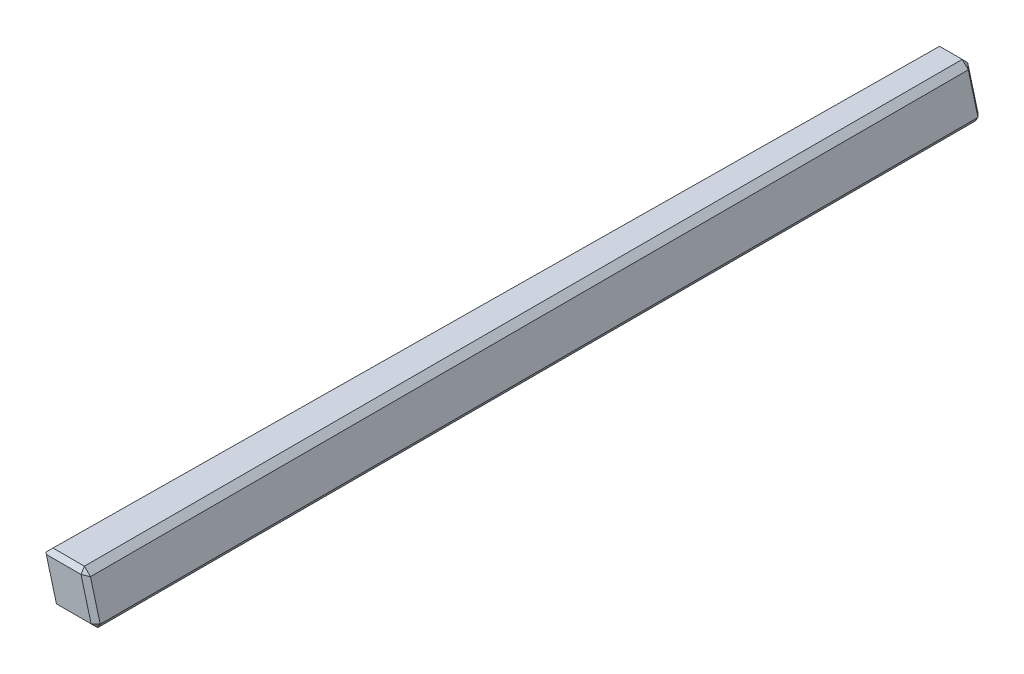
ISO-10303-21;
HEADER;
FILE_DESCRIPTION(('STEP AP214'),'2;1');
FILE_NAME('part.step','',(''),(''),'','','');
FILE_SCHEMA(('AUTOMOTIVE_DESIGN { 1 0 10303 214 1 1 1 1 }'));
ENDSEC;
DATA;
#1=APPLICATION_CONTEXT('core data for automotive mechanical design processes');
#2=APPLICATION_PROTOCOL_DEFINITION('international standard','automotive_design',2000,#1);
#3=PRODUCT_CONTEXT('',#1,'mechanical');
#4=PRODUCT('Part','Part','',(#3));
#5=PRODUCT_RELATED_PRODUCT_CATEGORY('part','',(#4));
#6=PRODUCT_DEFINITION_FORMATION('','',#4);
#7=PRODUCT_DEFINITION_CONTEXT('part definition',#1,'design');
#8=PRODUCT_DEFINITION('design','',#6,#7);
#9=PRODUCT_DEFINITION_SHAPE('','',#8);
#10=(LENGTH_UNIT() NAMED_UNIT(*) SI_UNIT(.MILLI.,.METRE.));
#11=(NAMED_UNIT(*) PLANE_ANGLE_UNIT() SI_UNIT($,.RADIAN.));
#12=(NAMED_UNIT(*) SI_UNIT($,.STERADIAN.) SOLID_ANGLE_UNIT());
#13=UNCERTAINTY_MEASURE_WITH_UNIT(LENGTH_MEASURE(1.E-05),#10,'distance_accuracy_value','');
#14=(GEOMETRIC_REPRESENTATION_CONTEXT(3) GLOBAL_UNCERTAINTY_ASSIGNED_CONTEXT((#13)) GLOBAL_UNIT_ASSIGNED_CONTEXT((#10,
#11,#12)) REPRESENTATION_CONTEXT('',''));
#15=CARTESIAN_POINT('',(0.,0.,0.));
#16=DIRECTION('',(0.,0.,1.));
#17=DIRECTION('',(1.,0.,0.));
#18=AXIS2_PLACEMENT_3D('',#15,#16,#17);
#19=CARTESIAN_POINT('',(0.,0.,-25.));
#20=DIRECTION('',(0.,0.,1.));
#21=DIRECTION('',(1.,0.,0.));
#22=AXIS2_PLACEMENT_3D('',#19,#20,#21);
#23=PLANE('',#22);
#24=DIRECTION('',(-1.,0.,0.));
#25=VECTOR('',#24,1.);
#26=CARTESIAN_POINT('',(-19.75,2.5,-25.));
#27=LINE('',#26,#25);
#28=CARTESIAN_POINT('',(-3.25806343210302,2.5,-25.));
#29=VERTEX_POINT('',#28);
#30=CARTESIAN_POINT('',(-17.8063167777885,2.5,-25.));
#31=VERTEX_POINT('',#30);
#32=EDGE_CURVE('E148',#29,#31,#27,.T.);
#33=ORIENTED_EDGE('',*,*,#32,.T.);
#34=DIRECTION('',(-0.258819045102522,0.965925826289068,0.));
#35=VECTOR('',#34,1.);
#36=CARTESIAN_POINT('',(-24.3585826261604,26.9533890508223,-25.));
#37=LINE('',#36,#35);
#38=CARTESIAN_POINT('',(-23.5136345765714,23.8,-25.));
#39=VERTEX_POINT('',#38);
#40=EDGE_CURVE('E157',#31,#39,#37,.T.);
#41=ORIENTED_EDGE('',*,*,#40,.T.);
#42=DIRECTION('',(1.,0.,0.));
#43=VECTOR('',#42,1.);
#44=CARTESIAN_POINT('',(-7.04706376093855,23.8,-25.));
#45=LINE('',#44,#43);
#46=CARTESIAN_POINT('',(-8.96538123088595,23.8,-25.));
#47=VERTEX_POINT('',#46);
#48=EDGE_CURVE('E184',#39,#47,#45,.T.);
#49=ORIENTED_EDGE('',*,*,#48,.T.);
#50=DIRECTION('',(0.258819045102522,-0.965925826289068,0.));
#51=VECTOR('',#50,1.);
#52=CARTESIAN_POINT('',(-2.41481456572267,-0.647047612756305,-25.));
#53=LINE('',#52,#51);
#54=EDGE_CURVE('E182',#47,#29,#53,.T.);
#55=ORIENTED_EDGE('',*,*,#54,.T.);
#56=EDGE_LOOP('',(#33,#41,#49,#55));
#57=FACE_BOUND('',#56,.T.);
#58=ADVANCED_FACE('F43',(#57),#23,.F.);
#59=CARTESIAN_POINT('',(0.,0.,475.));
#60=DIRECTION('',(0.,0.,1.));
#61=DIRECTION('',(1.,0.,0.));
#62=AXIS2_PLACEMENT_3D('',#59,#60,#61);
#63=PLANE('',#62);
#64=DIRECTION('',(-1.,0.,0.));
#65=VECTOR('',#64,1.);
#66=CARTESIAN_POINT('',(0.,23.7999999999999,475.));
#67=LINE('',#66,#65);
#68=CARTESIAN_POINT('',(-8.965381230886,23.7999999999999,475.));
#69=VERTEX_POINT('',#68);
#70=CARTESIAN_POINT('',(-28.5390003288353,23.7999999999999,475.));
#71=VERTEX_POINT('',#70);
#72=EDGE_CURVE('E191',#69,#71,#67,.T.);
#73=ORIENTED_EDGE('',*,*,#72,.T.);
#74=DIRECTION('',(0.258819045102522,-0.965925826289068,0.));
#75=VECTOR('',#74,1.);
#76=CARTESIAN_POINT('',(-20.6772498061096,-5.54045238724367,475.));
#77=LINE('',#76,#75);
#78=CARTESIAN_POINT('',(-22.8316825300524,2.50000000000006,475.));
#79=VERTEX_POINT('',#78);
#80=EDGE_CURVE('E193',#71,#79,#77,.T.);
#81=ORIENTED_EDGE('',*,*,#80,.T.);
#82=DIRECTION('',(1.,0.,0.));
#83=VECTOR('',#82,1.);
#84=CARTESIAN_POINT('',(0.,2.50000000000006,475.));
#85=LINE('',#84,#83);
#86=CARTESIAN_POINT('',(-3.25806343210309,2.50000000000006,475.));
#87=VERTEX_POINT('',#86);
#88=EDGE_CURVE('E187',#79,#87,#85,.T.);
#89=ORIENTED_EDGE('',*,*,#88,.T.);
#90=DIRECTION('',(-0.258819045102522,0.965925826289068,0.));
#91=VECTOR('',#90,1.);
#92=CARTESIAN_POINT('',(-2.41481456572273,-0.647047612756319,475.));
#93=LINE('',#92,#91);
#94=EDGE_CURVE('E189',#87,#69,#93,.T.);
#95=ORIENTED_EDGE('',*,*,#94,.T.);
#96=EDGE_LOOP('',(#73,#81,#89,#95));
#97=FACE_BOUND('',#96,.T.);
#98=ADVANCED_FACE('F342',(#97),#63,.T.);
#99=CARTESIAN_POINT('',(0.,0.,0.));
#100=DIRECTION('',(0.965925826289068,0.258819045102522,0.));
#101=DIRECTION('',(-0.258819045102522,0.965925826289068,0.));
#102=AXIS2_PLACEMENT_3D('',#99,#100,#101);
#103=PLANE('',#102);
#104=DIRECTION('',(0.,0.,1.));
#105=VECTOR('',#104,1.);
#106=CARTESIAN_POINT('',(-6.13200025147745,22.8849364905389,0.));
#107=LINE('',#106,#105);
#108=CARTESIAN_POINT('',(-6.13200025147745,22.8849364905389,-22.5));
#109=VERTEX_POINT('',#108);
#110=CARTESIAN_POINT('',(-6.13200025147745,22.8849364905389,472.5));
#111=VERTEX_POINT('',#110);
#112=EDGE_CURVE('E202',#109,#111,#107,.T.);
#113=ORIENTED_EDGE('',*,*,#112,.T.);
#114=DIRECTION('',(0.258819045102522,-0.965925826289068,0.));
#115=VECTOR('',#114,1.);
#116=CARTESIAN_POINT('',(0.,0.,472.5));
#117=LINE('',#116,#115);
#118=CARTESIAN_POINT('',(-0.647047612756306,2.41481456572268,472.5));
#119=VERTEX_POINT('',#118);
#120=EDGE_CURVE('E208',#111,#119,#117,.T.);
#121=ORIENTED_EDGE('',*,*,#120,.T.);
#122=DIRECTION('',(0.,0.,-1.));
#123=VECTOR('',#122,1.);
#124=CARTESIAN_POINT('',(-0.647047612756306,2.41481456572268,0.));
#125=LINE('',#124,#123);
#126=CARTESIAN_POINT('',(-0.647047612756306,2.41481456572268,-22.5));
#127=VERTEX_POINT('',#126);
#128=EDGE_CURVE('E206',#119,#127,#125,.T.);
#129=ORIENTED_EDGE('',*,*,#128,.T.);
#130=DIRECTION('',(-0.258819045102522,0.965925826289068,0.));
#131=VECTOR('',#130,1.);
#132=CARTESIAN_POINT('',(-7.04706376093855,26.3,-22.5));
#133=LINE('',#132,#131);
#134=EDGE_CURVE('E204',#127,#109,#133,.T.);
#135=ORIENTED_EDGE('',*,*,#134,.T.);
#136=EDGE_LOOP('',(#113,#121,#129,#135));
#137=FACE_BOUND('',#136,.T.);
#138=ADVANCED_FACE('F323',(#137),#103,.T.);
#139=CARTESIAN_POINT('',(0.,26.3,0.));
#140=DIRECTION('',(0.,1.,0.));
#141=DIRECTION('',(-1.,0.,0.));
#142=AXIS2_PLACEMENT_3D('',#139,#140,#141);
#143=PLANE('',#142);
#144=DIRECTION('',(-1.,0.,0.));
#145=VECTOR('',#144,1.);
#146=CARTESIAN_POINT('',(-26.7970637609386,26.3,-22.5));
#147=LINE('',#146,#145);
#148=CARTESIAN_POINT('',(-9.54706376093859,26.3,-22.5));
#149=VERTEX_POINT('',#148);
#150=CARTESIAN_POINT('',(-22.3218387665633,26.3,-22.5));
#151=VERTEX_POINT('',#150);
#152=EDGE_CURVE('E198',#149,#151,#147,.T.);
#153=ORIENTED_EDGE('',*,*,#152,.T.);
#154=DIRECTION('',(-0.00999950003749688,0.,0.999950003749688));
#155=VECTOR('',#154,1.);
#156=CARTESIAN_POINT('',(-22.5445843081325,26.3,-0.225445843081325));
#157=LINE('',#156,#155);
#158=CARTESIAN_POINT('',(-27.2718387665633,26.3,472.5));
#159=VERTEX_POINT('',#158);
#160=EDGE_CURVE('E65',#151,#159,#157,.T.);
#161=ORIENTED_EDGE('',*,*,#160,.T.);
#162=DIRECTION('',(1.,0.,0.));
#163=VECTOR('',#162,1.);
#164=CARTESIAN_POINT('',(0.,26.3,472.5));
#165=LINE('',#164,#163);
#166=CARTESIAN_POINT('',(-9.54706376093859,26.3,472.5));
#167=VERTEX_POINT('',#166);
#168=EDGE_CURVE('E200',#159,#167,#165,.T.);
#169=ORIENTED_EDGE('',*,*,#168,.T.);
#170=DIRECTION('',(0.,0.,-1.));
#171=VECTOR('',#170,1.);
#172=CARTESIAN_POINT('',(-9.54706376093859,26.3,0.));
#173=LINE('',#172,#171);
#174=EDGE_CURVE('E196',#167,#149,#173,.T.);
#175=ORIENTED_EDGE('',*,*,#174,.T.);
#176=EDGE_LOOP('',(#153,#161,#169,#175));
#177=FACE_BOUND('',#176,.T.);
#178=ADVANCED_FACE('F273',(#177),#143,.T.);
#179=CARTESIAN_POINT('',(0.,0.,0.));
#180=DIRECTION('',(0.,-1.,0.));
#181=DIRECTION('',(1.,0.,0.));
#182=AXIS2_PLACEMENT_3D('',#179,#180,#181);
#183=PLANE('',#182);
#184=DIRECTION('',(0.,0.,1.));
#185=VECTOR('',#184,1.);
#186=CARTESIAN_POINT('',(-2.04124145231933,0.,0.));
#187=LINE('',#186,#185);
#188=CARTESIAN_POINT('',(-2.04124145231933,0.,-22.5));
#189=VERTEX_POINT('',#188);
#190=CARTESIAN_POINT('',(-2.04124145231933,0.,472.5));
#191=VERTEX_POINT('',#190);
#192=EDGE_CURVE('E215',#189,#191,#187,.T.);
#193=ORIENTED_EDGE('',*,*,#192,.T.);
#194=DIRECTION('',(-1.,0.,0.));
#195=VECTOR('',#194,1.);
#196=CARTESIAN_POINT('',(0.,0.,472.5));
#197=LINE('',#196,#195);
#198=CARTESIAN_POINT('',(-22.2248750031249,0.,472.5));
#199=VERTEX_POINT('',#198);
#200=EDGE_CURVE('E217',#191,#199,#197,.T.);
#201=ORIENTED_EDGE('',*,*,#200,.T.);
#202=DIRECTION('',(0.00999950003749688,0.,-0.999950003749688));
#203=VECTOR('',#202,1.);
#204=CARTESIAN_POINT('',(-17.4981251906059,0.,-0.174981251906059));
#205=LINE('',#204,#203);
#206=CARTESIAN_POINT('',(-17.2748750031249,0.,-22.5));
#207=VERTEX_POINT('',#206);
#208=EDGE_CURVE('E211',#199,#207,#205,.T.);
#209=ORIENTED_EDGE('',*,*,#208,.T.);
#210=DIRECTION('',(1.,0.,0.));
#211=VECTOR('',#210,1.);
#212=CARTESIAN_POINT('',(0.,0.,-22.5));
#213=LINE('',#212,#211);
#214=EDGE_CURVE('E213',#207,#189,#213,.T.);
#215=ORIENTED_EDGE('',*,*,#214,.T.);
#216=EDGE_LOOP('',(#193,#201,#209,#215));
#217=FACE_BOUND('',#216,.T.);
#218=ADVANCED_FACE('F311',(#217),#183,.T.);
#219=CARTESIAN_POINT('',(-18.6585131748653,-4.99953353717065,-0.186585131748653));
#220=DIRECTION('',(-0.965880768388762,-0.258806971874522,-0.00965880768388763));
#221=DIRECTION('',(0.258819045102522,-0.965925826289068,0.));
#222=AXIS2_PLACEMENT_3D('',#219,#220,#221);
#223=PLANE('',#222);
#224=DIRECTION('',(-0.258819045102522,0.965925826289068,0.));
#225=VECTOR('',#224,1.);
#226=CARTESIAN_POINT('',(-23.0689622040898,-6.18130979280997,472.52391712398));
#227=LINE('',#226,#225);
#228=CARTESIAN_POINT('',(-25.6402859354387,3.41500101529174,472.52391712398));
#229=VERTEX_POINT('',#228);
#230=CARTESIAN_POINT('',(-30.8213309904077,22.7509243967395,472.52391712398));
#231=VERTEX_POINT('',#230);
#232=EDGE_CURVE('E149',#229,#231,#227,.T.);
#233=ORIENTED_EDGE('',*,*,#232,.T.);
#234=DIRECTION('',(0.00999950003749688,0.,-0.999950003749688));
#235=VECTOR('',#234,1.);
#236=CARTESIAN_POINT('',(-26.0934824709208,22.7509243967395,-0.260934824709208));
#237=LINE('',#236,#235);
#238=CARTESIAN_POINT('',(-25.8710906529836,22.7509243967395,-22.5001166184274));
#239=VERTEX_POINT('',#238);
#240=EDGE_CURVE('E146',#231,#239,#237,.T.);
#241=ORIENTED_EDGE('',*,*,#240,.T.);
#242=DIRECTION('',(0.258819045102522,-0.965925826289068,0.));
#243=VECTOR('',#242,1.);
#244=CARTESIAN_POINT('',(-19.7733242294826,-0.00624970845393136,-22.5001166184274));
#245=LINE('',#244,#243);
#246=CARTESIAN_POINT('',(-20.6900455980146,3.41500101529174,-22.5001166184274));
#247=VERTEX_POINT('',#246);
#248=EDGE_CURVE('E138',#239,#247,#245,.T.);
#249=ORIENTED_EDGE('',*,*,#248,.T.);
#250=DIRECTION('',(-0.00999950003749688,0.,0.999950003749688));
#251=VECTOR('',#250,1.);
#252=CARTESIAN_POINT('',(-20.912955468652,3.41500101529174,-0.20912955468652));
#253=LINE('',#252,#251);
#254=EDGE_CURVE('E143',#247,#229,#253,.T.);
#255=ORIENTED_EDGE('',*,*,#254,.T.);
#256=EDGE_LOOP('',(#233,#241,#249,#255));
#257=FACE_BOUND('',#256,.T.);
#258=ADVANCED_FACE('F141',(#257),#223,.T.);
#259=CARTESIAN_POINT('',(-2.41481456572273,-0.647047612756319,475.));
#260=DIRECTION('',(-0.683012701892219,-0.18301270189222,-0.707106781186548));
#261=DIRECTION('',(-0.258819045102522,0.965925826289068,0.));
#262=AXIS2_PLACEMENT_3D('',#259,#260,#261);
#263=PLANE('',#262);
#264=DIRECTION('',(-0.728778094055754,0.235364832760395,0.643028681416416));
#265=VECTOR('',#264,1.);
#266=CARTESIAN_POINT('',(-8.53158180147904,23.6599009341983,474.617242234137));
#267=LINE('',#266,#265);
#268=EDGE_CURVE('E178',#69,#111,#267,.F.);
#269=ORIENTED_EDGE('',*,*,#268,.F.);
#270=ORIENTED_EDGE('',*,*,#94,.F.);
#271=DIRECTION('',(0.722094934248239,-0.0235586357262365,-0.691392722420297));
#272=VECTOR('',#271,1.);
#273=CARTESIAN_POINT('',(-0.647047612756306,2.41481456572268,472.5));
#274=LINE('',#273,#272);
#275=EDGE_CURVE('E174',#119,#87,#274,.F.);
#276=ORIENTED_EDGE('',*,*,#275,.F.);
#277=ORIENTED_EDGE('',*,*,#120,.F.);
#278=EDGE_LOOP('',(#269,#270,#276,#277));
#279=FACE_BOUND('',#278,.T.);
#280=ADVANCED_FACE('F290',(#279),#263,.F.);
#281=CARTESIAN_POINT('',(0.,23.7999999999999,475.));
#282=DIRECTION('',(0.,-0.707106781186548,-0.707106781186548));
#283=DIRECTION('',(-1.,0.,0.));
#284=AXIS2_PLACEMENT_3D('',#281,#282,#283);
#285=PLANE('',#284);
#286=ORIENTED_EDGE('',*,*,#168,.F.);
#287=DIRECTION('',(-0.581199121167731,-0.575416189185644,0.575416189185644));
#288=VECTOR('',#287,1.);
#289=CARTESIAN_POINT('',(-19.7317753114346,33.7650398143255,465.034960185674));
#290=LINE('',#289,#288);
#291=CARTESIAN_POINT('',(-29.2476967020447,24.3438018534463,474.456198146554));
#292=VERTEX_POINT('',#291);
#293=EDGE_CURVE('E51',#159,#292,#290,.T.);
#294=ORIENTED_EDGE('',*,*,#293,.T.);
#295=DIRECTION('',(0.677661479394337,-0.51998794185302,0.51998794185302));
#296=VECTOR('',#295,1.);
#297=CARTESIAN_POINT('',(-15.4331756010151,13.7435469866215,485.056453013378));
#298=LINE('',#297,#296);
#299=EDGE_CURVE('E254',#71,#292,#298,.F.);
#300=ORIENTED_EDGE('',*,*,#299,.F.);
#301=ORIENTED_EDGE('',*,*,#72,.F.);
#302=DIRECTION('',(-0.162342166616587,0.697726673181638,-0.697726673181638));
#303=VECTOR('',#302,1.);
#304=CARTESIAN_POINT('',(-9.54706376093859,26.3,472.5));
#305=LINE('',#304,#303);
#306=EDGE_CURVE('E256',#167,#69,#305,.F.);
#307=ORIENTED_EDGE('',*,*,#306,.F.);
#308=EDGE_LOOP('',(#286,#294,#300,#301,#307));
#309=FACE_BOUND('',#308,.T.);
#310=ADVANCED_FACE('F282',(#309),#285,.F.);
#311=CARTESIAN_POINT('',(-0.647047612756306,2.41481456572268,472.5));
#312=DIRECTION('',(0.636852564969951,-0.367686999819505,0.67766147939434));
#313=DIRECTION('',(0.728707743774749,0.,-0.68482481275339));
#314=AXIS2_PLACEMENT_3D('',#311,#312,#313);
#315=PLANE('',#314);
#316=DIRECTION('',(-0.500000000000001,-0.866025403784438,0.));
#317=VECTOR('',#316,1.);
#318=CARTESIAN_POINT('',(-0.647047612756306,2.41481456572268,472.5));
#319=LINE('',#318,#317);
#320=EDGE_CURVE('E248',#119,#191,#319,.T.);
#321=ORIENTED_EDGE('',*,*,#320,.F.);
#322=ORIENTED_EDGE('',*,*,#275,.T.);
#323=DIRECTION('',(-0.325434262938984,0.66861518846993,0.66861518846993));
#324=VECTOR('',#323,1.);
#325=CARTESIAN_POINT('',(-2.41902612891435,0.776170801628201,473.276170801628));
#326=LINE('',#325,#324);
#327=EDGE_CURVE('E251',#191,#87,#326,.T.);
#328=ORIENTED_EDGE('',*,*,#327,.F.);
#329=EDGE_LOOP('',(#321,#322,#328));
#330=FACE_BOUND('',#329,.T.);
#331=ADVANCED_FACE('F325',(#330),#315,.T.);
#332=CARTESIAN_POINT('',(-9.54706376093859,26.3,472.5));
#333=DIRECTION('',(0.621514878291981,0.621514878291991,0.476905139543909));
#334=DIRECTION('',(-0.707106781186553,0.707106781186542,0.));
#335=AXIS2_PLACEMENT_3D('',#332,#333,#334);
#336=PLANE('',#335);
#337=ORIENTED_EDGE('',*,*,#306,.T.);
#338=ORIENTED_EDGE('',*,*,#268,.T.);
#339=DIRECTION('',(0.707106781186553,-0.707106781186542,0.));
#340=VECTOR('',#339,1.);
#341=CARTESIAN_POINT('',(-9.54706376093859,26.3,472.5));
#342=LINE('',#341,#340);
#343=EDGE_CURVE('E245',#167,#111,#342,.T.);
#344=ORIENTED_EDGE('',*,*,#343,.F.);
#345=EDGE_LOOP('',(#337,#338,#344));
#346=FACE_BOUND('',#345,.T.);
#347=ADVANCED_FACE('F293',(#346),#336,.T.);
#348=CARTESIAN_POINT('',(-20.6772498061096,-5.54045238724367,475.));
#349=DIRECTION('',(0.683012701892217,0.183012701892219,-0.70710678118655));
#350=DIRECTION('',(0.258819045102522,-0.965925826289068,0.));
#351=AXIS2_PLACEMENT_3D('',#348,#349,#350);
#352=PLANE('',#351);
#353=ORIENTED_EDGE('',*,*,#299,.T.);
#354=DIRECTION('',(-0.532067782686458,-0.538574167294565,-0.65333126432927));
#355=VECTOR('',#354,1.);
#356=CARTESIAN_POINT('',(-35.1959729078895,18.3227872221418,467.152251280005));
#357=LINE('',#356,#355);
#358=EDGE_CURVE('E12',#292,#231,#357,.T.);
#359=ORIENTED_EDGE('',*,*,#358,.T.);
#360=ORIENTED_EDGE('',*,*,#232,.F.);
#361=DIRECTION('',(0.728672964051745,-0.237390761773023,0.642402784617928));
#362=VECTOR('',#361,1.);
#363=CARTESIAN_POINT('',(-22.8316825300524,2.50000000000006,475.));
#364=LINE('',#363,#362);
#365=EDGE_CURVE('E242',#79,#229,#364,.F.);
#366=ORIENTED_EDGE('',*,*,#365,.F.);
#367=ORIENTED_EDGE('',*,*,#80,.F.);
#368=EDGE_LOOP('',(#353,#359,#360,#366,#367));
#369=FACE_BOUND('',#368,.T.);
#370=ADVANCED_FACE('F278',(#369),#352,.F.);
#371=CARTESIAN_POINT('',(0.,2.50000000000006,475.));
#372=DIRECTION('',(0.,0.707106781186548,-0.707106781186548));
#373=DIRECTION('',(1.,0.,0.));
#374=AXIS2_PLACEMENT_3D('',#371,#372,#373);
#375=PLANE('',#374);
#376=ORIENTED_EDGE('',*,*,#327,.T.);
#377=ORIENTED_EDGE('',*,*,#88,.F.);
#378=DIRECTION('',(0.169157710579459,-0.696916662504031,-0.696916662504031));
#379=VECTOR('',#378,1.);
#380=CARTESIAN_POINT('',(-22.8316825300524,2.50000000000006,475.));
#381=LINE('',#380,#379);
#382=EDGE_CURVE('E240',#199,#79,#381,.F.);
#383=ORIENTED_EDGE('',*,*,#382,.F.);
#384=ORIENTED_EDGE('',*,*,#200,.F.);
#385=EDGE_LOOP('',(#376,#377,#383,#384));
#386=FACE_BOUND('',#385,.T.);
#387=ADVANCED_FACE('F330',(#386),#375,.F.);
#388=CARTESIAN_POINT('',(-0.647047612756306,2.41481456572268,0.));
#389=DIRECTION('',(-0.866025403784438,0.5,0.));
#390=DIRECTION('',(0.,0.,-1.));
#391=AXIS2_PLACEMENT_3D('',#388,#389,#390);
#392=PLANE('',#391);
#393=ORIENTED_EDGE('',*,*,#320,.T.);
#394=ORIENTED_EDGE('',*,*,#192,.F.);
#395=DIRECTION('',(0.500000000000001,0.866025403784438,0.));
#396=VECTOR('',#395,1.);
#397=CARTESIAN_POINT('',(-0.647047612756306,2.41481456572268,-22.5));
#398=LINE('',#397,#396);
#399=EDGE_CURVE('E237',#127,#189,#398,.F.);
#400=ORIENTED_EDGE('',*,*,#399,.F.);
#401=ORIENTED_EDGE('',*,*,#128,.F.);
#402=EDGE_LOOP('',(#393,#394,#400,#401));
#403=FACE_BOUND('',#402,.T.);
#404=ADVANCED_FACE('F314',(#403),#392,.F.);
#405=CARTESIAN_POINT('',(0.,0.,-22.5));
#406=DIRECTION('',(0.683012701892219,0.18301270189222,-0.707106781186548));
#407=DIRECTION('',(0.258819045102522,-0.965925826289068,0.));
#408=AXIS2_PLACEMENT_3D('',#405,#406,#407);
#409=PLANE('',#408);
#410=DIRECTION('',(-0.728778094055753,0.235364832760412,-0.643028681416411));
#411=VECTOR('',#410,1.);
#412=CARTESIAN_POINT('',(-8.96538123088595,23.8,-25.));
#413=LINE('',#412,#411);
#414=EDGE_CURVE('E231',#109,#47,#413,.T.);
#415=ORIENTED_EDGE('',*,*,#414,.F.);
#416=ORIENTED_EDGE('',*,*,#134,.F.);
#417=DIRECTION('',(0.722094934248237,-0.0235586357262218,0.6913927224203));
#418=VECTOR('',#417,1.);
#419=CARTESIAN_POINT('',(-0.647047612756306,2.41481456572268,-22.5));
#420=LINE('',#419,#418);
#421=EDGE_CURVE('E234',#29,#127,#420,.T.);
#422=ORIENTED_EDGE('',*,*,#421,.F.);
#423=ORIENTED_EDGE('',*,*,#54,.F.);
#424=EDGE_LOOP('',(#415,#416,#422,#423));
#425=FACE_BOUND('',#424,.T.);
#426=ADVANCED_FACE('F321',(#425),#409,.T.);
#427=CARTESIAN_POINT('',(-9.54706376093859,26.3,0.));
#428=DIRECTION('',(-0.707106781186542,-0.707106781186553,0.));
#429=DIRECTION('',(0.,0.,-1.));
#430=AXIS2_PLACEMENT_3D('',#427,#428,#429);
#431=PLANE('',#430);
#432=ORIENTED_EDGE('',*,*,#343,.T.);
#433=ORIENTED_EDGE('',*,*,#112,.F.);
#434=DIRECTION('',(-0.707106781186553,0.707106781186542,0.));
#435=VECTOR('',#434,1.);
#436=CARTESIAN_POINT('',(-8.00622249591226,24.7591587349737,-22.5));
#437=LINE('',#436,#435);
#438=EDGE_CURVE('E228',#149,#109,#437,.F.);
#439=ORIENTED_EDGE('',*,*,#438,.F.);
#440=ORIENTED_EDGE('',*,*,#174,.F.);
#441=EDGE_LOOP('',(#432,#433,#439,#440));
#442=FACE_BOUND('',#441,.T.);
#443=ADVANCED_FACE('F296',(#442),#431,.F.);
#444=CARTESIAN_POINT('',(-22.8316825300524,2.50000000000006,475.));
#445=DIRECTION('',(-0.621043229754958,-0.624435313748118,0.473693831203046));
#446=DIRECTION('',(0.709029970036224,-0.705178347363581,0.));
#447=AXIS2_PLACEMENT_3D('',#444,#445,#446);
#448=PLANE('',#447);
#449=ORIENTED_EDGE('',*,*,#382,.T.);
#450=ORIENTED_EDGE('',*,*,#365,.T.);
#451=DIRECTION('',(-0.707140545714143,0.707055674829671,0.00495189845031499));
#452=VECTOR('',#451,1.);
#453=CARTESIAN_POINT('',(-23.7870313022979,1.56196880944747,472.510939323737));
#454=LINE('',#453,#452);
#455=EDGE_CURVE('E173',#199,#229,#454,.T.);
#456=ORIENTED_EDGE('',*,*,#455,.F.);
#457=EDGE_LOOP('',(#449,#450,#456));
#458=FACE_BOUND('',#457,.T.);
#459=ADVANCED_FACE('F332',(#458),#448,.T.);
#460=CARTESIAN_POINT('',(-0.647047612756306,2.41481456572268,-22.5));
#461=DIRECTION('',(0.636852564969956,-0.367686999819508,-0.677661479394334));
#462=DIRECTION('',(-0.728707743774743,0.,-0.684824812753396));
#463=AXIS2_PLACEMENT_3D('',#460,#461,#462);
#464=PLANE('',#463);
#465=ORIENTED_EDGE('',*,*,#421,.T.);
#466=ORIENTED_EDGE('',*,*,#399,.T.);
#467=DIRECTION('',(-0.325434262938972,0.668615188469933,-0.668615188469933));
#468=VECTOR('',#467,1.);
#469=CARTESIAN_POINT('',(-2.41902612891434,0.77617080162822,-23.2761708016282));
#470=LINE('',#469,#468);
#471=EDGE_CURVE('E224',#29,#189,#470,.F.);
#472=ORIENTED_EDGE('',*,*,#471,.F.);
#473=EDGE_LOOP('',(#465,#466,#472));
#474=FACE_BOUND('',#473,.T.);
#475=ADVANCED_FACE('F318',(#474),#464,.T.);
#476=CARTESIAN_POINT('',(-8.96538123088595,23.8,-25.));
#477=DIRECTION('',(0.621514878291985,0.621514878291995,-0.476905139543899));
#478=DIRECTION('',(-0.707106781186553,0.707106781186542,0.));
#479=AXIS2_PLACEMENT_3D('',#476,#477,#478);
#480=PLANE('',#479);
#481=ORIENTED_EDGE('',*,*,#438,.T.);
#482=ORIENTED_EDGE('',*,*,#414,.T.);
#483=DIRECTION('',(-0.162342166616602,0.697726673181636,0.697726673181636));
#484=VECTOR('',#483,1.);
#485=CARTESIAN_POINT('',(-8.96538123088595,23.8,-25.));
#486=LINE('',#485,#484);
#487=EDGE_CURVE('E168',#149,#47,#486,.F.);
#488=ORIENTED_EDGE('',*,*,#487,.F.);
#489=EDGE_LOOP('',(#481,#482,#488));
#490=FACE_BOUND('',#489,.T.);
#491=ADVANCED_FACE('F300',(#490),#480,.T.);
#492=CARTESIAN_POINT('',(-17.4981251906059,0.,-0.174981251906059));
#493=DIRECTION('',(0.707071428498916,0.707106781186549,0.00707071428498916));
#494=DIRECTION('',(0.00999950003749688,0.,-0.999950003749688));
#495=AXIS2_PLACEMENT_3D('',#492,#493,#494);
#496=PLANE('',#495);
#497=ORIENTED_EDGE('',*,*,#455,.T.);
#498=ORIENTED_EDGE('',*,*,#254,.F.);
#499=DIRECTION('',(0.707124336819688,-0.707089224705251,2.41462983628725E-05));
#500=VECTOR('',#499,1.);
#501=CARTESIAN_POINT('',(-20.6900455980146,3.41500101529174,-22.5001166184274));
#502=LINE('',#501,#500);
#503=EDGE_CURVE('E163',#207,#247,#502,.F.);
#504=ORIENTED_EDGE('',*,*,#503,.F.);
#505=ORIENTED_EDGE('',*,*,#208,.F.);
#506=EDGE_LOOP('',(#497,#498,#504,#505));
#507=FACE_BOUND('',#506,.T.);
#508=ADVANCED_FACE('F171',(#507),#496,.F.);
#509=CARTESIAN_POINT('',(0.,0.,-22.5));
#510=DIRECTION('',(0.,-0.707106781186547,-0.707106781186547));
#511=DIRECTION('',(-1.,0.,0.));
#512=AXIS2_PLACEMENT_3D('',#509,#510,#511);
#513=PLANE('',#512);
#514=ORIENTED_EDGE('',*,*,#471,.T.);
#515=ORIENTED_EDGE('',*,*,#214,.F.);
#516=DIRECTION('',(0.14864454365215,-0.699251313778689,0.699251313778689));
#517=VECTOR('',#516,1.);
#518=CARTESIAN_POINT('',(-17.7053008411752,2.02480242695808,-24.5248024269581));
#519=LINE('',#518,#517);
#520=EDGE_CURVE('E166',#31,#207,#519,.T.);
#521=ORIENTED_EDGE('',*,*,#520,.F.);
#522=ORIENTED_EDGE('',*,*,#32,.F.);
#523=EDGE_LOOP('',(#514,#515,#521,#522));
#524=FACE_BOUND('',#523,.T.);
#525=ADVANCED_FACE('F307',(#524),#513,.T.);
#526=CARTESIAN_POINT('',(0.,26.3,-22.5));
#527=DIRECTION('',(0.,0.707106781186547,-0.707106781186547));
#528=DIRECTION('',(1.,0.,0.));
#529=AXIS2_PLACEMENT_3D('',#526,#527,#528);
#530=PLANE('',#529);
#531=DIRECTION('',(-0.683280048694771,0.516298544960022,0.516298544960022));
#532=VECTOR('',#531,1.);
#533=CARTESIAN_POINT('',(-14.299668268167,16.8377633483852,-31.9622366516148));
#534=LINE('',#533,#532);
#535=CARTESIAN_POINT('',(-24.2477628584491,24.3547203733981,-24.4452796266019));
#536=VERTEX_POINT('',#535);
#537=EDGE_CURVE('E160',#536,#39,#534,.F.);
#538=ORIENTED_EDGE('',*,*,#537,.F.);
#539=DIRECTION('',(-0.573501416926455,-0.579265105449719,-0.579265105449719));
#540=VECTOR('',#539,1.);
#541=CARTESIAN_POINT('',(-14.9800994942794,33.7155237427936,-15.0844762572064));
#542=LINE('',#541,#540);
#543=EDGE_CURVE('E264',#536,#151,#542,.F.);
#544=ORIENTED_EDGE('',*,*,#543,.T.);
#545=ORIENTED_EDGE('',*,*,#152,.F.);
#546=ORIENTED_EDGE('',*,*,#487,.T.);
#547=ORIENTED_EDGE('',*,*,#48,.F.);
#548=EDGE_LOOP('',(#538,#544,#545,#546,#547));
#549=FACE_BOUND('',#548,.T.);
#550=ADVANCED_FACE('F270',(#549),#530,.T.);
#551=CARTESIAN_POINT('',(-20.6900455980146,3.41500101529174,-22.5001166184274));
#552=DIRECTION('',(-0.617765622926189,-0.617812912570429,-0.486490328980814));
#553=DIRECTION('',(0.707133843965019,-0.707079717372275,0.));
#554=AXIS2_PLACEMENT_3D('',#551,#552,#553);
#555=PLANE('',#554);
#556=ORIENTED_EDGE('',*,*,#520,.T.);
#557=ORIENTED_EDGE('',*,*,#503,.T.);
#558=DIRECTION('',(0.734781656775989,-0.23314465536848,-0.636976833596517));
#559=VECTOR('',#558,1.);
#560=CARTESIAN_POINT('',(-20.6900455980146,3.41500101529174,-22.5001166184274));
#561=LINE('',#560,#559);
#562=EDGE_CURVE('E153',#31,#247,#561,.F.);
#563=ORIENTED_EDGE('',*,*,#562,.F.);
#564=EDGE_LOOP('',(#556,#557,#563));
#565=FACE_BOUND('',#564,.T.);
#566=ADVANCED_FACE('F164',(#565),#555,.T.);
#567=CARTESIAN_POINT('',(-18.4503250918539,-4.94374970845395,-22.5001166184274));
#568=DIRECTION('',(-0.676383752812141,-0.181236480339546,-0.713903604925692));
#569=DIRECTION('',(-0.258819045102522,0.965925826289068,0.));
#570=AXIS2_PLACEMENT_3D('',#567,#568,#569);
#571=PLANE('',#570);
#572=ORIENTED_EDGE('',*,*,#248,.F.);
#573=DIRECTION('',(-0.541379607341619,-0.534865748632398,0.648711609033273));
#574=VECTOR('',#573,1.);
#575=CARTESIAN_POINT('',(-31.715544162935,16.9767911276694,-15.4969624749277));
#576=LINE('',#575,#574);
#577=EDGE_CURVE('E262',#239,#536,#576,.F.);
#578=ORIENTED_EDGE('',*,*,#577,.T.);
#579=ORIENTED_EDGE('',*,*,#537,.T.);
#580=ORIENTED_EDGE('',*,*,#40,.F.);
#581=ORIENTED_EDGE('',*,*,#562,.T.);
#582=EDGE_LOOP('',(#572,#578,#579,#580,#581));
#583=FACE_BOUND('',#582,.T.);
#584=ADVANCED_FACE('F155',(#583),#571,.T.);
#585=CARTESIAN_POINT('',(-26.0934824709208,22.7509243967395,-0.260934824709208));
#586=DIRECTION('',(0.707071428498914,-0.707106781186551,0.00707071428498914));
#587=DIRECTION('',(0.00999950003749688,0.,-0.999950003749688));
#588=AXIS2_PLACEMENT_3D('',#585,#586,#587);
#589=PLANE('',#588);
#590=ORIENTED_EDGE('',*,*,#293,.F.);
#591=ORIENTED_EDGE('',*,*,#160,.F.);
#592=ORIENTED_EDGE('',*,*,#543,.F.);
#593=ORIENTED_EDGE('',*,*,#577,.F.);
#594=ORIENTED_EDGE('',*,*,#240,.F.);
#595=ORIENTED_EDGE('',*,*,#358,.F.);
#596=EDGE_LOOP('',(#590,#591,#592,#593,#594,#595));
#597=FACE_BOUND('',#596,.T.);
#598=ADVANCED_FACE('F45',(#597),#589,.F.);
#599=CLOSED_SHELL('',(#58,#98,#138,#178,#218,#258,#280,#310,#331,#347,#370,#387,#404,#426,#443,
#459,#475,#491,#508,#525,#550,#566,#584,#598));
#600=MANIFOLD_SOLID_BREP('B2',#599);
#601=ADVANCED_BREP_SHAPE_REPRESENTATION('',(#18,#600),#14);
#602=SHAPE_DEFINITION_REPRESENTATION(#9,#601);
ENDSEC;
END-ISO-10303-21;
